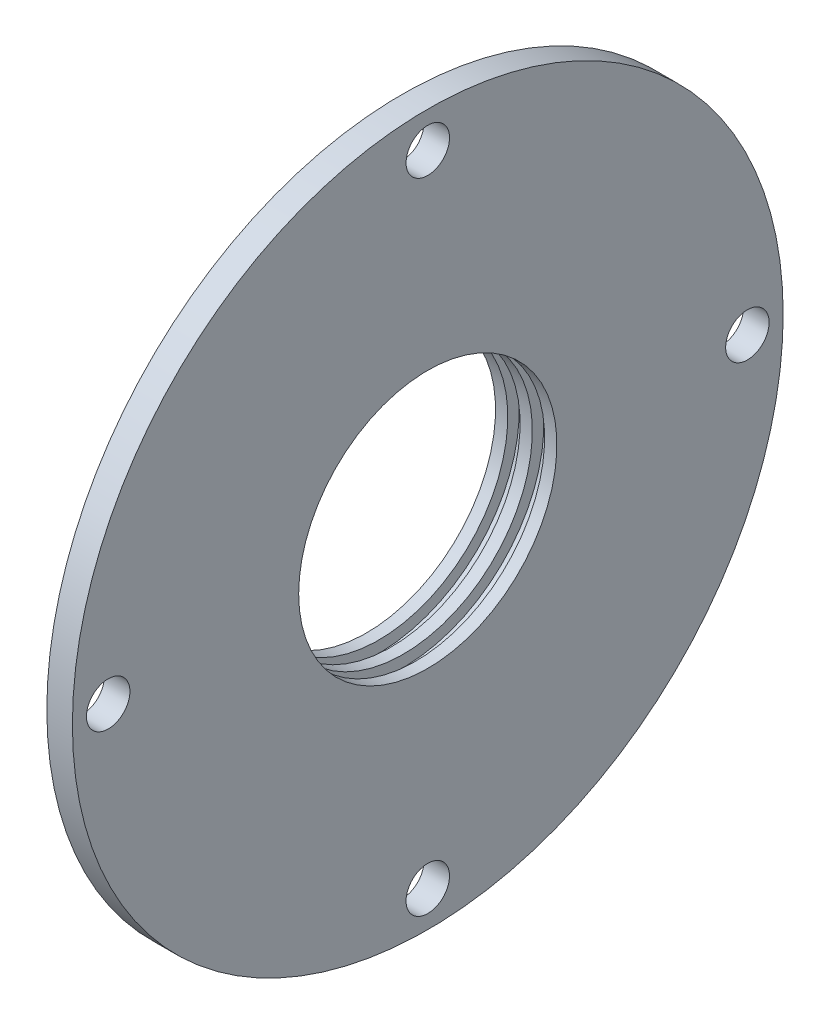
ISO-10303-21;
HEADER;
FILE_DESCRIPTION(('STEP AP214'),'2;1');
FILE_NAME('part.step','',(''),(''),'','','');
FILE_SCHEMA(('AUTOMOTIVE_DESIGN { 1 0 10303 214 1 1 1 1 }'));
ENDSEC;
DATA;
#1=APPLICATION_CONTEXT('core data for automotive mechanical design processes');
#2=APPLICATION_PROTOCOL_DEFINITION('international standard','automotive_design',2000,#1);
#3=PRODUCT_CONTEXT('',#1,'mechanical');
#4=PRODUCT('Part','Part','',(#3));
#5=PRODUCT_RELATED_PRODUCT_CATEGORY('part','',(#4));
#6=PRODUCT_DEFINITION_FORMATION('','',#4);
#7=PRODUCT_DEFINITION_CONTEXT('part definition',#1,'design');
#8=PRODUCT_DEFINITION('design','',#6,#7);
#9=PRODUCT_DEFINITION_SHAPE('','',#8);
#10=(LENGTH_UNIT() NAMED_UNIT(*) SI_UNIT(.MILLI.,.METRE.));
#11=(NAMED_UNIT(*) PLANE_ANGLE_UNIT() SI_UNIT($,.RADIAN.));
#12=(NAMED_UNIT(*) SI_UNIT($,.STERADIAN.) SOLID_ANGLE_UNIT());
#13=UNCERTAINTY_MEASURE_WITH_UNIT(LENGTH_MEASURE(1.E-05),#10,'distance_accuracy_value','');
#14=(GEOMETRIC_REPRESENTATION_CONTEXT(3) GLOBAL_UNCERTAINTY_ASSIGNED_CONTEXT((#13)) GLOBAL_UNIT_ASSIGNED_CONTEXT((#10,
#11,#12)) REPRESENTATION_CONTEXT('',''));
#15=CARTESIAN_POINT('',(0.,0.,0.));
#16=DIRECTION('',(0.,0.,1.));
#17=DIRECTION('',(1.,0.,0.));
#18=AXIS2_PLACEMENT_3D('',#15,#16,#17);
#19=CARTESIAN_POINT('',(-7.00000000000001,35.,0.));
#20=DIRECTION('',(1.,0.,0.));
#21=DIRECTION('',(0.,0.,-1.));
#22=AXIS2_PLACEMENT_3D('',#19,#20,#21);
#23=PLANE('',#22);
#24=CARTESIAN_POINT('',(-7.00000000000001,0.,0.));
#25=DIRECTION('',(1.,0.,0.));
#26=DIRECTION('',(0.,0.,-1.));
#27=AXIS2_PLACEMENT_3D('',#24,#25,#26);
#28=CIRCLE('',#27,33.8452994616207);
#29=CARTESIAN_POINT('',(-7.00000000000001,0.,-33.8452994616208));
#30=VERTEX_POINT('',#29);
#31=EDGE_CURVE('E457',#30,#30,#28,.F.);
#32=ORIENTED_EDGE('',*,*,#31,.T.);
#33=EDGE_LOOP('',(#32));
#34=FACE_BOUND('',#33,.T.);
#35=CARTESIAN_POINT('',(-7.00000000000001,0.,0.));
#36=DIRECTION('',(-1.,0.,0.));
#37=DIRECTION('',(0.,0.,1.));
#38=AXIS2_PLACEMENT_3D('',#35,#36,#37);
#39=CIRCLE('',#38,25.25);
#40=CARTESIAN_POINT('',(-7.00000000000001,0.,25.25));
#41=VERTEX_POINT('',#40);
#42=EDGE_CURVE('E461',#41,#41,#39,.T.);
#43=ORIENTED_EDGE('',*,*,#42,.F.);
#44=EDGE_LOOP('',(#43));
#45=FACE_BOUND('',#44,.T.);
#46=ADVANCED_FACE('F451',(#34,#45),#23,.F.);
#47=CARTESIAN_POINT('',(-15.1011722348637,0.,0.));
#48=DIRECTION('',(-1.,0.,0.));
#49=DIRECTION('',(0.,0.,1.));
#50=AXIS2_PLACEMENT_3D('',#47,#48,#49);
#51=CYLINDRICAL_SURFACE('',#50,25.25);
#52=CARTESIAN_POINT('',(-4.59999999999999,0.,0.));
#53=DIRECTION('',(-1.,0.,0.));
#54=DIRECTION('',(0.,0.,1.));
#55=AXIS2_PLACEMENT_3D('',#52,#53,#54);
#56=CIRCLE('',#55,25.25);
#57=CARTESIAN_POINT('',(-4.59999999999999,0.,25.25));
#58=VERTEX_POINT('',#57);
#59=EDGE_CURVE('E465',#58,#58,#56,.T.);
#60=ORIENTED_EDGE('',*,*,#59,.F.);
#61=EDGE_LOOP('',(#60));
#62=FACE_BOUND('',#61,.T.);
#63=ORIENTED_EDGE('',*,*,#42,.T.);
#64=EDGE_LOOP('',(#63));
#65=FACE_BOUND('',#64,.T.);
#66=ADVANCED_FACE('F591',(#62,#65),#51,.F.);
#67=CARTESIAN_POINT('',(-4.59999999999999,27.5000000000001,0.));
#68=DIRECTION('',(-1.,0.,0.));
#69=DIRECTION('',(0.,0.,1.));
#70=AXIS2_PLACEMENT_3D('',#67,#68,#69);
#71=PLANE('',#70);
#72=CARTESIAN_POINT('',(-4.59999999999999,0.,0.));
#73=DIRECTION('',(-1.,0.,0.));
#74=DIRECTION('',(0.,0.,1.));
#75=AXIS2_PLACEMENT_3D('',#72,#73,#74);
#76=CIRCLE('',#75,27.5);
#77=CARTESIAN_POINT('',(-4.59999999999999,0.,27.5));
#78=VERTEX_POINT('',#77);
#79=EDGE_CURVE('E487',#78,#78,#76,.T.);
#80=ORIENTED_EDGE('',*,*,#79,.F.);
#81=EDGE_LOOP('',(#80));
#82=FACE_BOUND('',#81,.T.);
#83=ORIENTED_EDGE('',*,*,#59,.T.);
#84=EDGE_LOOP('',(#83));
#85=FACE_BOUND('',#84,.T.);
#86=ADVANCED_FACE('F585',(#82,#85),#71,.F.);
#87=CARTESIAN_POINT('',(-15.1011722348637,0.,0.));
#88=DIRECTION('',(-1.,0.,0.));
#89=DIRECTION('',(0.,0.,1.));
#90=AXIS2_PLACEMENT_3D('',#87,#88,#89);
#91=CYLINDRICAL_SURFACE('',#90,27.5);
#92=CARTESIAN_POINT('',(-2.20000000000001,0.,0.));
#93=DIRECTION('',(-1.,0.,0.));
#94=DIRECTION('',(0.,0.,1.));
#95=AXIS2_PLACEMENT_3D('',#92,#93,#94);
#96=CIRCLE('',#95,27.5);
#97=CARTESIAN_POINT('',(-2.20000000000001,0.,27.5));
#98=VERTEX_POINT('',#97);
#99=EDGE_CURVE('E490',#98,#98,#96,.T.);
#100=ORIENTED_EDGE('',*,*,#99,.F.);
#101=EDGE_LOOP('',(#100));
#102=FACE_BOUND('',#101,.T.);
#103=ORIENTED_EDGE('',*,*,#79,.T.);
#104=EDGE_LOOP('',(#103));
#105=FACE_BOUND('',#104,.T.);
#106=ADVANCED_FACE('F579',(#102,#105),#91,.F.);
#107=CARTESIAN_POINT('',(-2.20000000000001,27.5000000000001,0.));
#108=DIRECTION('',(1.,0.,0.));
#109=DIRECTION('',(0.,0.,-1.));
#110=AXIS2_PLACEMENT_3D('',#107,#108,#109);
#111=PLANE('',#110);
#112=CARTESIAN_POINT('',(-2.19999999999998,0.,0.));
#113=DIRECTION('',(-1.,0.,0.));
#114=DIRECTION('',(0.,0.,1.));
#115=AXIS2_PLACEMENT_3D('',#112,#113,#114);
#116=CIRCLE('',#115,25.25);
#117=CARTESIAN_POINT('',(-2.19999999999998,0.,25.25));
#118=VERTEX_POINT('',#117);
#119=EDGE_CURVE('E493',#118,#118,#116,.T.);
#120=ORIENTED_EDGE('',*,*,#119,.F.);
#121=EDGE_LOOP('',(#120));
#122=FACE_BOUND('',#121,.T.);
#123=ORIENTED_EDGE('',*,*,#99,.T.);
#124=EDGE_LOOP('',(#123));
#125=FACE_BOUND('',#124,.T.);
#126=ADVANCED_FACE('F573',(#122,#125),#111,.F.);
#127=CARTESIAN_POINT('',(-15.1011722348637,0.,0.));
#128=DIRECTION('',(-1.,0.,0.));
#129=DIRECTION('',(0.,0.,1.));
#130=AXIS2_PLACEMENT_3D('',#127,#128,#129);
#131=CYLINDRICAL_SURFACE('',#130,25.25);
#132=CARTESIAN_POINT('',(0.200000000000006,0.,0.));
#133=DIRECTION('',(-1.,0.,0.));
#134=DIRECTION('',(0.,0.,1.));
#135=AXIS2_PLACEMENT_3D('',#132,#133,#134);
#136=CIRCLE('',#135,25.25);
#137=CARTESIAN_POINT('',(0.200000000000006,0.,25.25));
#138=VERTEX_POINT('',#137);
#139=EDGE_CURVE('E496',#138,#138,#136,.T.);
#140=ORIENTED_EDGE('',*,*,#139,.F.);
#141=EDGE_LOOP('',(#140));
#142=FACE_BOUND('',#141,.T.);
#143=ORIENTED_EDGE('',*,*,#119,.T.);
#144=EDGE_LOOP('',(#143));
#145=FACE_BOUND('',#144,.T.);
#146=ADVANCED_FACE('F567',(#142,#145),#131,.F.);
#147=CARTESIAN_POINT('',(0.200000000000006,27.5000000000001,0.));
#148=DIRECTION('',(-1.,0.,0.));
#149=DIRECTION('',(0.,0.,1.));
#150=AXIS2_PLACEMENT_3D('',#147,#148,#149);
#151=PLANE('',#150);
#152=CARTESIAN_POINT('',(0.200000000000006,0.,0.));
#153=DIRECTION('',(-1.,0.,0.));
#154=DIRECTION('',(0.,0.,1.));
#155=AXIS2_PLACEMENT_3D('',#152,#153,#154);
#156=CIRCLE('',#155,27.5);
#157=CARTESIAN_POINT('',(0.200000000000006,0.,27.5));
#158=VERTEX_POINT('',#157);
#159=EDGE_CURVE('E499',#158,#158,#156,.T.);
#160=ORIENTED_EDGE('',*,*,#159,.F.);
#161=EDGE_LOOP('',(#160));
#162=FACE_BOUND('',#161,.T.);
#163=ORIENTED_EDGE('',*,*,#139,.T.);
#164=EDGE_LOOP('',(#163));
#165=FACE_BOUND('',#164,.T.);
#166=ADVANCED_FACE('F561',(#162,#165),#151,.F.);
#167=CARTESIAN_POINT('',(-15.1011722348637,0.,0.));
#168=DIRECTION('',(-1.,0.,0.));
#169=DIRECTION('',(0.,0.,1.));
#170=AXIS2_PLACEMENT_3D('',#167,#168,#169);
#171=CYLINDRICAL_SURFACE('',#170,27.5);
#172=CARTESIAN_POINT('',(2.59999999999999,0.,0.));
#173=DIRECTION('',(-1.,0.,0.));
#174=DIRECTION('',(0.,0.,1.));
#175=AXIS2_PLACEMENT_3D('',#172,#173,#174);
#176=CIRCLE('',#175,27.5);
#177=CARTESIAN_POINT('',(2.59999999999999,0.,27.5));
#178=VERTEX_POINT('',#177);
#179=EDGE_CURVE('E502',#178,#178,#176,.T.);
#180=ORIENTED_EDGE('',*,*,#179,.F.);
#181=EDGE_LOOP('',(#180));
#182=FACE_BOUND('',#181,.T.);
#183=ORIENTED_EDGE('',*,*,#159,.T.);
#184=EDGE_LOOP('',(#183));
#185=FACE_BOUND('',#184,.T.);
#186=ADVANCED_FACE('F555',(#182,#185),#171,.F.);
#187=CARTESIAN_POINT('',(2.60000000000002,25.2500000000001,0.));
#188=DIRECTION('',(1.,0.,0.));
#189=DIRECTION('',(0.,0.,-1.));
#190=AXIS2_PLACEMENT_3D('',#187,#188,#189);
#191=PLANE('',#190);
#192=CARTESIAN_POINT('',(2.59999999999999,0.,0.));
#193=DIRECTION('',(-1.,0.,0.));
#194=DIRECTION('',(0.,0.,1.));
#195=AXIS2_PLACEMENT_3D('',#192,#193,#194);
#196=CIRCLE('',#195,25.25);
#197=CARTESIAN_POINT('',(2.59999999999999,0.,25.25));
#198=VERTEX_POINT('',#197);
#199=EDGE_CURVE('E505',#198,#198,#196,.T.);
#200=ORIENTED_EDGE('',*,*,#199,.F.);
#201=EDGE_LOOP('',(#200));
#202=FACE_BOUND('',#201,.T.);
#203=ORIENTED_EDGE('',*,*,#179,.T.);
#204=EDGE_LOOP('',(#203));
#205=FACE_BOUND('',#204,.T.);
#206=ADVANCED_FACE('F549',(#202,#205),#191,.F.);
#207=CARTESIAN_POINT('',(-15.1011722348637,0.,0.));
#208=DIRECTION('',(-1.,0.,0.));
#209=DIRECTION('',(0.,0.,1.));
#210=AXIS2_PLACEMENT_3D('',#207,#208,#209);
#211=CYLINDRICAL_SURFACE('',#210,25.25);
#212=CARTESIAN_POINT('',(5.,0.,0.));
#213=DIRECTION('',(-1.,0.,0.));
#214=DIRECTION('',(0.,0.,1.));
#215=AXIS2_PLACEMENT_3D('',#212,#213,#214);
#216=CIRCLE('',#215,25.25);
#217=CARTESIAN_POINT('',(5.,0.,25.25));
#218=VERTEX_POINT('',#217);
#219=EDGE_CURVE('E508',#218,#218,#216,.T.);
#220=ORIENTED_EDGE('',*,*,#219,.F.);
#221=EDGE_LOOP('',(#220));
#222=FACE_BOUND('',#221,.T.);
#223=ORIENTED_EDGE('',*,*,#199,.T.);
#224=EDGE_LOOP('',(#223));
#225=FACE_BOUND('',#224,.T.);
#226=ADVANCED_FACE('F535',(#222,#225),#211,.F.);
#227=CARTESIAN_POINT('',(5.,69.5000000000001,0.));
#228=DIRECTION('',(-1.,0.,0.));
#229=DIRECTION('',(0.,0.,1.));
#230=AXIS2_PLACEMENT_3D('',#227,#228,#229);
#231=PLANE('',#230);
#232=CARTESIAN_POINT('',(5.,6.54653130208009E-13,-62.5000000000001));
#233=DIRECTION('',(1.,0.,0.));
#234=DIRECTION('',(0.,-1.,0.));
#235=AXIS2_PLACEMENT_3D('',#232,#233,#234);
#236=CIRCLE('',#235,4.25);
#237=CARTESIAN_POINT('',(5.,-4.24999999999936,-62.5000000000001));
#238=VERTEX_POINT('',#237);
#239=EDGE_CURVE('E472',#238,#238,#236,.T.);
#240=ORIENTED_EDGE('',*,*,#239,.F.);
#241=EDGE_LOOP('',(#240));
#242=FACE_BOUND('',#241,.T.);
#243=CARTESIAN_POINT('',(5.,-62.5000000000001,-4.36435420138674E-13));
#244=DIRECTION('',(1.,0.,0.));
#245=DIRECTION('',(0.,0.,1.));
#246=AXIS2_PLACEMENT_3D('',#243,#244,#245);
#247=CIRCLE('',#246,4.25);
#248=CARTESIAN_POINT('',(5.,-62.5000000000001,4.24999999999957));
#249=VERTEX_POINT('',#248);
#250=EDGE_CURVE('E471',#249,#249,#247,.T.);
#251=ORIENTED_EDGE('',*,*,#250,.F.);
#252=EDGE_LOOP('',(#251));
#253=FACE_BOUND('',#252,.T.);
#254=CARTESIAN_POINT('',(4.99999999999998,-2.18217710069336E-13,62.5000000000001));
#255=DIRECTION('',(1.,0.,0.));
#256=DIRECTION('',(0.,1.,0.));
#257=AXIS2_PLACEMENT_3D('',#254,#255,#256);
#258=CIRCLE('',#257,4.25);
#259=CARTESIAN_POINT('',(4.99999999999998,4.24999999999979,62.5000000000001));
#260=VERTEX_POINT('',#259);
#261=EDGE_CURVE('E476',#260,#260,#258,.T.);
#262=ORIENTED_EDGE('',*,*,#261,.F.);
#263=EDGE_LOOP('',(#262));
#264=FACE_BOUND('',#263,.T.);
#265=CARTESIAN_POINT('',(5.,62.5000000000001,0.));
#266=DIRECTION('',(1.,0.,0.));
#267=DIRECTION('',(0.,0.,-1.));
#268=AXIS2_PLACEMENT_3D('',#265,#266,#267);
#269=CIRCLE('',#268,4.25);
#270=CARTESIAN_POINT('',(5.,62.5000000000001,-4.25000000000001));
#271=VERTEX_POINT('',#270);
#272=EDGE_CURVE('E480',#271,#271,#269,.T.);
#273=ORIENTED_EDGE('',*,*,#272,.F.);
#274=EDGE_LOOP('',(#273));
#275=FACE_BOUND('',#274,.T.);
#276=CARTESIAN_POINT('',(5.,0.,0.));
#277=DIRECTION('',(-1.,0.,0.));
#278=DIRECTION('',(0.,0.,1.));
#279=AXIS2_PLACEMENT_3D('',#276,#277,#278);
#280=CIRCLE('',#279,69.5);
#281=CARTESIAN_POINT('',(5.,0.,69.5000000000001));
#282=VERTEX_POINT('',#281);
#283=EDGE_CURVE('E511',#282,#282,#280,.T.);
#284=ORIENTED_EDGE('',*,*,#283,.F.);
#285=EDGE_LOOP('',(#284));
#286=FACE_BOUND('',#285,.T.);
#287=ORIENTED_EDGE('',*,*,#219,.T.);
#288=EDGE_LOOP('',(#287));
#289=FACE_BOUND('',#288,.T.);
#290=ADVANCED_FACE('F531',(#242,#253,#264,#275,#286,#289),#231,.F.);
#291=CARTESIAN_POINT('',(-15.1011722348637,0.,0.));
#292=DIRECTION('',(-1.,0.,0.));
#293=DIRECTION('',(0.,0.,1.));
#294=AXIS2_PLACEMENT_3D('',#291,#292,#293);
#295=CYLINDRICAL_SURFACE('',#294,69.5);
#296=CARTESIAN_POINT('',(0.,0.,0.));
#297=DIRECTION('',(-1.,0.,0.));
#298=DIRECTION('',(0.,0.,1.));
#299=AXIS2_PLACEMENT_3D('',#296,#297,#298);
#300=CIRCLE('',#299,69.5);
#301=CARTESIAN_POINT('',(0.,0.,69.5000000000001));
#302=VERTEX_POINT('',#301);
#303=EDGE_CURVE('E514',#302,#302,#300,.T.);
#304=ORIENTED_EDGE('',*,*,#303,.F.);
#305=EDGE_LOOP('',(#304));
#306=FACE_BOUND('',#305,.T.);
#307=ORIENTED_EDGE('',*,*,#283,.T.);
#308=EDGE_LOOP('',(#307));
#309=FACE_BOUND('',#308,.T.);
#310=ADVANCED_FACE('F534',(#306,#309),#295,.T.);
#311=CARTESIAN_POINT('',(0.,35.,0.));
#312=DIRECTION('',(1.,0.,0.));
#313=DIRECTION('',(0.,0.,-1.));
#314=AXIS2_PLACEMENT_3D('',#311,#312,#313);
#315=PLANE('',#314);
#316=CARTESIAN_POINT('',(0.,6.54653130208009E-13,-62.5000000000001));
#317=DIRECTION('',(1.,0.,0.));
#318=DIRECTION('',(0.,0.,-1.));
#319=AXIS2_PLACEMENT_3D('',#316,#317,#318);
#320=CIRCLE('',#319,4.25);
#321=CARTESIAN_POINT('',(0.,6.54653130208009E-13,-66.7500000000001));
#322=VERTEX_POINT('',#321);
#323=EDGE_CURVE('E468',#322,#322,#320,.T.);
#324=ORIENTED_EDGE('',*,*,#323,.T.);
#325=EDGE_LOOP('',(#324));
#326=FACE_BOUND('',#325,.T.);
#327=CARTESIAN_POINT('',(0.,-62.5000000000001,-4.36435420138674E-13));
#328=DIRECTION('',(1.,0.,0.));
#329=DIRECTION('',(0.,0.,-1.));
#330=AXIS2_PLACEMENT_3D('',#327,#328,#329);
#331=CIRCLE('',#330,4.25);
#332=CARTESIAN_POINT('',(0.,-62.5000000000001,-4.25000000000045));
#333=VERTEX_POINT('',#332);
#334=EDGE_CURVE('E473',#333,#333,#331,.T.);
#335=ORIENTED_EDGE('',*,*,#334,.T.);
#336=EDGE_LOOP('',(#335));
#337=FACE_BOUND('',#336,.T.);
#338=CARTESIAN_POINT('',(0.,-2.18217710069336E-13,62.5000000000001));
#339=DIRECTION('',(1.,0.,0.));
#340=DIRECTION('',(0.,0.,-1.));
#341=AXIS2_PLACEMENT_3D('',#338,#339,#340);
#342=CIRCLE('',#341,4.25);
#343=CARTESIAN_POINT('',(0.,-2.18217710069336E-13,58.2500000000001));
#344=VERTEX_POINT('',#343);
#345=EDGE_CURVE('E477',#344,#344,#342,.T.);
#346=ORIENTED_EDGE('',*,*,#345,.T.);
#347=EDGE_LOOP('',(#346));
#348=FACE_BOUND('',#347,.T.);
#349=CARTESIAN_POINT('',(0.,62.5000000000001,0.));
#350=DIRECTION('',(1.,0.,0.));
#351=DIRECTION('',(0.,0.,-1.));
#352=AXIS2_PLACEMENT_3D('',#349,#350,#351);
#353=CIRCLE('',#352,4.25);
#354=CARTESIAN_POINT('',(0.,62.5000000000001,-4.25000000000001));
#355=VERTEX_POINT('',#354);
#356=EDGE_CURVE('E481',#355,#355,#353,.T.);
#357=ORIENTED_EDGE('',*,*,#356,.T.);
#358=EDGE_LOOP('',(#357));
#359=FACE_BOUND('',#358,.T.);
#360=CARTESIAN_POINT('',(0.,0.,0.));
#361=DIRECTION('',(-1.,0.,0.));
#362=DIRECTION('',(0.,0.,1.));
#363=AXIS2_PLACEMENT_3D('',#360,#361,#362);
#364=CIRCLE('',#363,35.);
#365=CARTESIAN_POINT('',(0.,0.,35.0000000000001));
#366=VERTEX_POINT('',#365);
#367=EDGE_CURVE('E483',#366,#366,#364,.T.);
#368=ORIENTED_EDGE('',*,*,#367,.F.);
#369=EDGE_LOOP('',(#368));
#370=FACE_BOUND('',#369,.T.);
#371=ORIENTED_EDGE('',*,*,#303,.T.);
#372=EDGE_LOOP('',(#371));
#373=FACE_BOUND('',#372,.T.);
#374=ADVANCED_FACE('F648',(#326,#337,#348,#359,#370,#373),#315,.F.);
#375=CARTESIAN_POINT('',(-15.1011722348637,0.,0.));
#376=DIRECTION('',(-1.,0.,0.));
#377=DIRECTION('',(0.,0.,1.));
#378=AXIS2_PLACEMENT_3D('',#375,#376,#377);
#379=CYLINDRICAL_SURFACE('',#378,35.);
#380=CARTESIAN_POINT('',(-4.99999999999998,0.,0.));
#381=DIRECTION('',(1.,0.,0.));
#382=DIRECTION('',(0.,0.,-1.));
#383=AXIS2_PLACEMENT_3D('',#380,#381,#382);
#384=CIRCLE('',#383,35.);
#385=CARTESIAN_POINT('',(-4.99999999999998,0.,-35.0000000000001));
#386=VERTEX_POINT('',#385);
#387=EDGE_CURVE('E10',#386,#386,#384,.T.);
#388=ORIENTED_EDGE('',*,*,#387,.T.);
#389=EDGE_LOOP('',(#388));
#390=FACE_BOUND('',#389,.T.);
#391=ORIENTED_EDGE('',*,*,#367,.T.);
#392=EDGE_LOOP('',(#391));
#393=FACE_BOUND('',#392,.T.);
#394=ADVANCED_FACE('F656',(#390,#393),#379,.T.);
#395=CARTESIAN_POINT('',(-7.00000000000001,62.5000000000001,0.));
#396=DIRECTION('',(1.,0.,0.));
#397=DIRECTION('',(0.,0.,-1.));
#398=AXIS2_PLACEMENT_3D('',#395,#396,#397);
#399=CYLINDRICAL_SURFACE('',#398,4.25);
#400=ORIENTED_EDGE('',*,*,#272,.T.);
#401=EDGE_LOOP('',(#400));
#402=FACE_BOUND('',#401,.T.);
#403=ORIENTED_EDGE('',*,*,#356,.F.);
#404=EDGE_LOOP('',(#403));
#405=FACE_BOUND('',#404,.T.);
#406=ADVANCED_FACE('F664',(#402,#405),#399,.F.);
#407=CARTESIAN_POINT('',(-7.00000000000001,-2.18217710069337E-13,62.5000000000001));
#408=DIRECTION('',(1.,0.,0.));
#409=DIRECTION('',(0.,0.,-1.));
#410=AXIS2_PLACEMENT_3D('',#407,#408,#409);
#411=CYLINDRICAL_SURFACE('',#410,4.25);
#412=ORIENTED_EDGE('',*,*,#261,.T.);
#413=EDGE_LOOP('',(#412));
#414=FACE_BOUND('',#413,.T.);
#415=ORIENTED_EDGE('',*,*,#345,.F.);
#416=EDGE_LOOP('',(#415));
#417=FACE_BOUND('',#416,.T.);
#418=ADVANCED_FACE('F671',(#414,#417),#411,.F.);
#419=CARTESIAN_POINT('',(-7.00000000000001,-62.5000000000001,-4.36435420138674E-13));
#420=DIRECTION('',(1.,0.,0.));
#421=DIRECTION('',(0.,0.,-1.));
#422=AXIS2_PLACEMENT_3D('',#419,#420,#421);
#423=CYLINDRICAL_SURFACE('',#422,4.25);
#424=ORIENTED_EDGE('',*,*,#250,.T.);
#425=EDGE_LOOP('',(#424));
#426=FACE_BOUND('',#425,.T.);
#427=ORIENTED_EDGE('',*,*,#334,.F.);
#428=EDGE_LOOP('',(#427));
#429=FACE_BOUND('',#428,.T.);
#430=ADVANCED_FACE('F679',(#426,#429),#423,.F.);
#431=CARTESIAN_POINT('',(-6.99999999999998,6.54653130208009E-13,-62.5000000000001));
#432=DIRECTION('',(1.,0.,0.));
#433=DIRECTION('',(0.,0.,-1.));
#434=AXIS2_PLACEMENT_3D('',#431,#432,#433);
#435=CYLINDRICAL_SURFACE('',#434,4.25);
#436=ORIENTED_EDGE('',*,*,#239,.T.);
#437=EDGE_LOOP('',(#436));
#438=FACE_BOUND('',#437,.T.);
#439=ORIENTED_EDGE('',*,*,#323,.F.);
#440=EDGE_LOOP('',(#439));
#441=FACE_BOUND('',#440,.T.);
#442=ADVANCED_FACE('F528',(#438,#441),#435,.F.);
#443=CARTESIAN_POINT('',(-7.00000000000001,0.,0.));
#444=DIRECTION('',(1.,0.,0.));
#445=DIRECTION('',(0.,0.,-1.));
#446=AXIS2_PLACEMENT_3D('',#443,#444,#445);
#447=CONICAL_SURFACE('',#446,33.8452994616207,0.523598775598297);
#448=ORIENTED_EDGE('',*,*,#387,.F.);
#449=EDGE_LOOP('',(#448));
#450=FACE_BOUND('',#449,.T.);
#451=ORIENTED_EDGE('',*,*,#31,.F.);
#452=EDGE_LOOP('',(#451));
#453=FACE_BOUND('',#452,.T.);
#454=ADVANCED_FACE('F694',(#450,#453),#447,.T.);
#455=CLOSED_SHELL('',(#46,#66,#86,#106,#126,#146,#166,#186,#206,#226,#290,#310,#374,#394,#406,
#418,#430,#442,#454));
#456=MANIFOLD_SOLID_BREP('B2',#455);
#457=ADVANCED_BREP_SHAPE_REPRESENTATION('',(#18,#456),#14);
#458=SHAPE_DEFINITION_REPRESENTATION(#9,#457);
ENDSEC;
END-ISO-10303-21;
